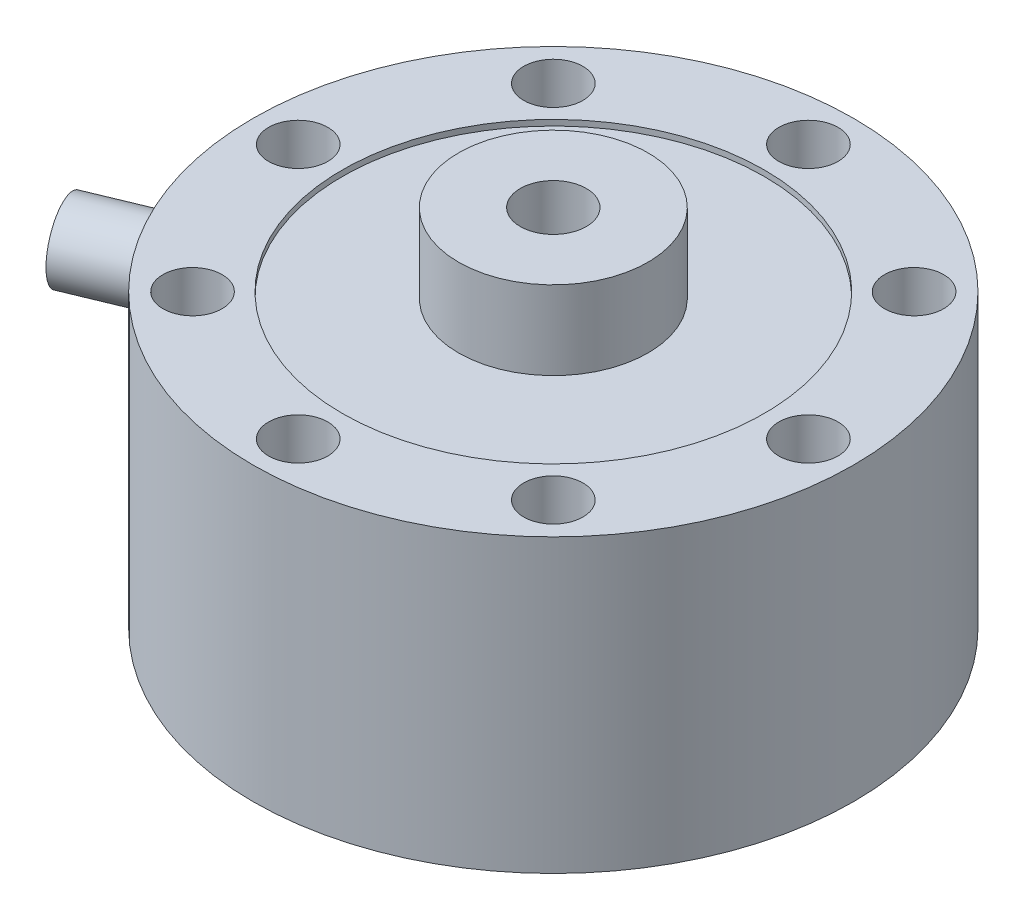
from build123d import *
from build123d.topology import SkipClean

# Parameters (mm, degrees)
SKETCH1_R                            = 52.324
BOSS_EXTRUDE1_DEPTH                  = 50.8
SKETCH2_R                            = 16.51
BOSS_EXTRUDE2_DEPTH                  = 12.7
BOSS_EXTRUDE3_START                  = 1.27
SKETCH3_R                            = 16.51
BOSS_EXTRUDE3_DEPTH                  = 1.27
F_1_2_20_TAPPED_HOLE1_D              = 11.50874
F_1_2_20_TAPPED_HOLE1_DEPTH          = 33.9598
F_1_2_20_TAPPED_HOLE1_TIP            = 3.45757432
F_1_2_20_TAPPED_HOLE2_D              = 11.50874
F_1_2_20_TAPPED_HOLE2_DEPTH          = 20.828
F_1_2_20_TAPPED_HOLE2_TIP            = 3.45757432
SKETCH18_R                           = 3.5941
CUT_EXTRUDE2_DEPTH                   = 91.481417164
SKETCH19_R                           = 5.1562
CUT_EXTRUDE3_DEPTH                   = 7.62
CIRPATTERN1_COUNT                    = 8
CUT_EXTRUDE4_START                   = -1
SKETCH20_R                           = 36.763613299
SKETCH20_R_2                         = 16.51
CUT_EXTRUDE4_DEPTH                   = 1
SKETCH22_R                           = 6.35
BOSS_EXTRUDE4_DEPTH                  = 12.7
BOSS_EXTRUDE4_DIRECTION_2_REACH      = 141.283
BOSS_EXTRUDE4_DIRECTION_2_END_RADIUS = 52.324


with BuildPart() as part:
    # Sketch1 → Boss-Extrude1 (new body)
    with BuildSketch(Plane(origin=(0, 0, 0), x_dir=(1, 0, 0), z_dir=(0, 1, 0))):
        with Locations(Location((0, 0, 0), (0, 0, 270))):
            Circle(SKETCH1_R)
    extrude(amount=BOSS_EXTRUDE1_DEPTH)

    # Sketch2 → Boss-Extrude2 (add)
    with BuildSketch(Plane(origin=(0, 50.8, 0), x_dir=(1, 0, 0), z_dir=(0, 1, 0))):
        with Locations(Location((0, 0, 0), (0, 0, 270))):
            Circle(SKETCH2_R)
    extrude(amount=BOSS_EXTRUDE2_DEPTH)

    # Sketch3 → Boss-Extrude3 (add)
    with BuildSketch(Plane.XZ.offset(BOSS_EXTRUDE3_START)):
        with Locations(Location((0, 0, 0), (0, 0, 90))):
            Circle(SKETCH3_R)
    extrude(amount=-BOSS_EXTRUDE3_DEPTH)

    # 1_2-20 Tapped Hole1
    with Locations(Plane(origin=(0, 63.5, 0), x_dir=(1, 0, 0), z_dir=(0, 1, 0))):
        with Locations((0, 0)):
            Hole(F_1_2_20_TAPPED_HOLE1_D / 2, depth=F_1_2_20_TAPPED_HOLE1_DEPTH)
            with Locations((0, 0, -(F_1_2_20_TAPPED_HOLE1_DEPTH + F_1_2_20_TAPPED_HOLE1_TIP / 2))):  # 118° drill point
                Cone(0, F_1_2_20_TAPPED_HOLE1_D / 2, F_1_2_20_TAPPED_HOLE1_TIP, mode=Mode.SUBTRACT)

    # 1_2-20 Tapped Hole2
    with Locations(Plane(origin=(0, -1.27, 0), x_dir=(-1, 0, 0), z_dir=(0, -1, 0))):
        with Locations((0, 0)):
            Hole(F_1_2_20_TAPPED_HOLE2_D / 2, depth=F_1_2_20_TAPPED_HOLE2_DEPTH)
            with Locations((0, 0, -(F_1_2_20_TAPPED_HOLE2_DEPTH + F_1_2_20_TAPPED_HOLE2_TIP / 2))):  # 118° drill point
                Cone(0, F_1_2_20_TAPPED_HOLE2_D / 2, F_1_2_20_TAPPED_HOLE2_TIP, mode=Mode.SUBTRACT)

    # Sketch18 → Cut-Extrude2 (cut, through all)
    with BuildSketch(Plane(origin=(0, 50.8, 0), x_dir=(1, 0, 0), z_dir=(0, 1, 0))):
        with Locations(Location((0, 44.45, 0), (0, 0, 270))):
            Circle(SKETCH18_R)
    cut_extrude2 = extrude(amount=-CUT_EXTRUDE2_DEPTH, mode=Mode.SUBTRACT)

    # Sketch19 → Cut-Extrude3 (cut)
    with BuildSketch(Plane(origin=(0, 50.8, 0), x_dir=(1, 0, 0), z_dir=(0, 1, 0))):
        with Locations(Location((0, 44.45, 0), (0, 0, 270))):
            Circle(SKETCH19_R)
    cut_extrude3 = extrude(amount=-CUT_EXTRUDE3_DEPTH, mode=Mode.SUBTRACT)

    # CirPattern1: Cut-Extrude2, Cut-Extrude3 ×8 about axis
    cirpattern1_axis = Axis((0, 0, 0), (0, 1, 0))
    add([cut_extrude2.rotate(cirpattern1_axis, i * 360 / CIRPATTERN1_COUNT) for i in range(1, CIRPATTERN1_COUNT)], mode=Mode.SUBTRACT)
    add([cut_extrude3.rotate(cirpattern1_axis, i * 360 / CIRPATTERN1_COUNT) for i in range(1, CIRPATTERN1_COUNT)], mode=Mode.SUBTRACT)

    # Sketch20 → Cut-Extrude4 (cut)
    with BuildSketch(Plane(origin=(0, 50.8, 0), x_dir=(1, 0, 0), z_dir=(0, 1, 0)).offset(CUT_EXTRUDE4_START)):
        with Locations(Location((0, 0, 0), (0, 0, 270))):
            Circle(SKETCH20_R)
        with Locations(Location((0, 0, 0), (0, 0, 270))):
            Circle(SKETCH20_R_2, mode=Mode.SUBTRACT)
    extrude(amount=CUT_EXTRUDE4_DEPTH, mode=Mode.SUBTRACT)

    # Sketch22 → Boss-Extrude4 (add)
    with BuildSketch(Plane(origin=(-48.341072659, 0, 20.023527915), x_dir=(0.38268343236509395, 0, 0.9238795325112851), z_dir=(-0.9238795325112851, 0, 0.38268343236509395))):
        with Locations(Location((0, 41.019683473, 0), (0, 0, 180))):
            Circle(SKETCH22_R)
    extrude(amount=BOSS_EXTRUDE4_DEPTH)

    # Boss-Extrude4 direction 2: up to this cylinder (the profile starts outside it)
    with SkipClean():  # the faces are left unmerged after this step: merging them gives an invalid solid
        boss_extrude4_direction_2_end = Plane(origin=(0, 41.019683, 0), z_dir=(0, -1, 0)) * Cylinder(BOSS_EXTRUDE4_DIRECTION_2_END_RADIUS, 388.214, mode=Mode.PRIVATE)
        # Sketch22 → Boss-Extrude4 direction 2 (add, up to the surface)
        with BuildSketch(Plane(origin=(-48.341072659, 0, 20.023527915), x_dir=(0.38268343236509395, 0, 0.9238795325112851), z_dir=(-0.9238795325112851, 0, 0.38268343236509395)), mode=Mode.PRIVATE) as boss_extrude4_direction_2_sk1:
            with Locations(Location((0, 41.019683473, 0), (0, 0, 180))):
                Circle(SKETCH22_R)
        boss_extrude4_direction_2_tool1 = extrude(boss_extrude4_direction_2_sk1.sketch, amount=-BOSS_EXTRUDE4_DIRECTION_2_REACH, mode=Mode.PRIVATE) - boss_extrude4_direction_2_end
        add(boss_extrude4_direction_2_tool1.solids().sort_by_distance((-48.341073, 41.019683, 20.023528))[0])
        add(boss_extrude4_direction_2_tool1.solids().sort_by_distance((-48.341073, 41.019683, 20.023528))[1])


solid = part.part
